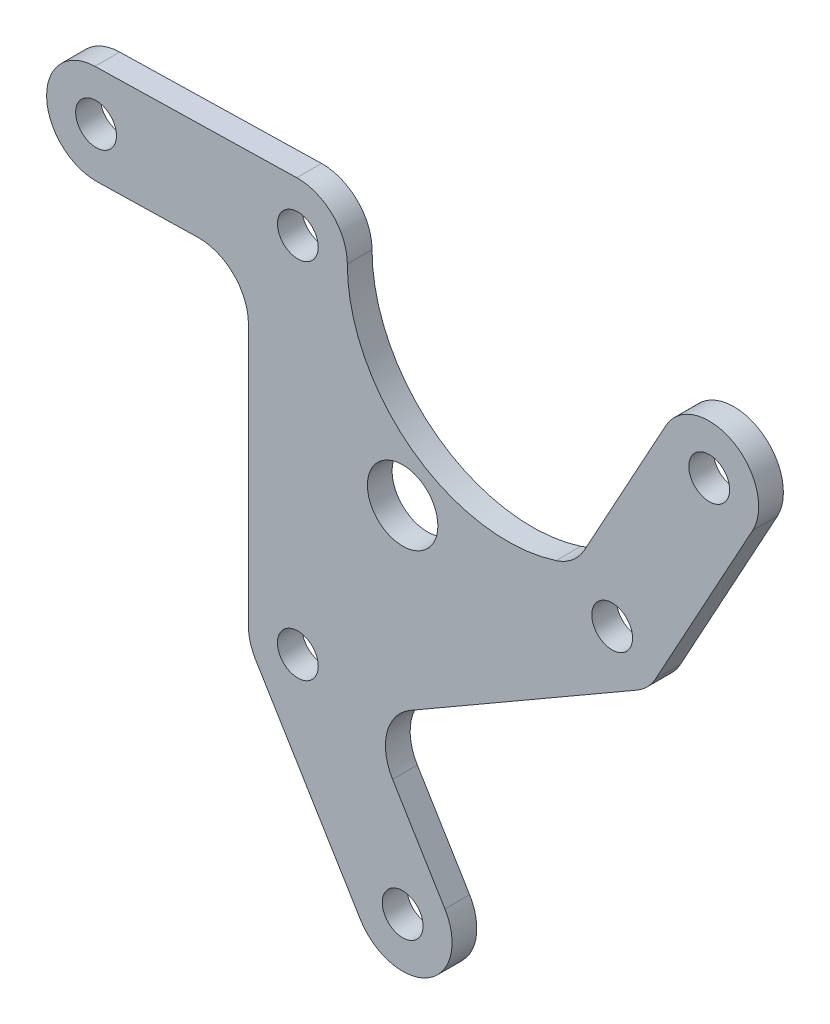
ISO-10303-21;
HEADER;
FILE_DESCRIPTION(('STEP AP214'),'2;1');
FILE_NAME('part.step','',(''),(''),'','','');
FILE_SCHEMA(('AUTOMOTIVE_DESIGN { 1 0 10303 214 1 1 1 1 }'));
ENDSEC;
DATA;
#1=APPLICATION_CONTEXT('core data for automotive mechanical design processes');
#2=APPLICATION_PROTOCOL_DEFINITION('international standard','automotive_design',2000,#1);
#3=PRODUCT_CONTEXT('',#1,'mechanical');
#4=PRODUCT('Part','Part','',(#3));
#5=PRODUCT_RELATED_PRODUCT_CATEGORY('part','',(#4));
#6=PRODUCT_DEFINITION_FORMATION('','',#4);
#7=PRODUCT_DEFINITION_CONTEXT('part definition',#1,'design');
#8=PRODUCT_DEFINITION('design','',#6,#7);
#9=PRODUCT_DEFINITION_SHAPE('','',#8);
#10=(LENGTH_UNIT() NAMED_UNIT(*) SI_UNIT(.MILLI.,.METRE.));
#11=(NAMED_UNIT(*) PLANE_ANGLE_UNIT() SI_UNIT($,.RADIAN.));
#12=(NAMED_UNIT(*) SI_UNIT($,.STERADIAN.) SOLID_ANGLE_UNIT());
#13=UNCERTAINTY_MEASURE_WITH_UNIT(LENGTH_MEASURE(1.E-05),#10,'distance_accuracy_value','');
#14=(GEOMETRIC_REPRESENTATION_CONTEXT(3) GLOBAL_UNCERTAINTY_ASSIGNED_CONTEXT((#13)) GLOBAL_UNIT_ASSIGNED_CONTEXT((#10,
#11,#12)) REPRESENTATION_CONTEXT('',''));
#15=CARTESIAN_POINT('',(0.,0.,0.));
#16=DIRECTION('',(0.,0.,1.));
#17=DIRECTION('',(1.,0.,0.));
#18=AXIS2_PLACEMENT_3D('',#15,#16,#17);
#19=CARTESIAN_POINT('',(-8.47500000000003,14.6791305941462,2.));
#20=DIRECTION('',(0.,0.,-1.));
#21=DIRECTION('',(-1.,0.,0.));
#22=AXIS2_PLACEMENT_3D('',#19,#20,#21);
#23=CYLINDRICAL_SURFACE('',#22,3.99999999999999);
#24=DIRECTION('',(0.,0.,-1.));
#25=VECTOR('',#24,1.);
#26=CARTESIAN_POINT('',(-8.56339345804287,18.6781537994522,2.));
#27=LINE('',#26,#25);
#28=CARTESIAN_POINT('',(-8.56339345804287,18.6781537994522,2.));
#29=VERTEX_POINT('',#28);
#30=CARTESIAN_POINT('',(-8.56339345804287,18.6781537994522,0.));
#31=VERTEX_POINT('',#30);
#32=EDGE_CURVE('E295',#29,#31,#27,.T.);
#33=ORIENTED_EDGE('',*,*,#32,.F.);
#34=CARTESIAN_POINT('',(-8.47500000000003,14.6791305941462,2.));
#35=DIRECTION('',(0.,0.,1.));
#36=DIRECTION('',(1.,0.,0.));
#37=AXIS2_PLACEMENT_3D('',#34,#35,#36);
#38=CIRCLE('',#37,3.99999999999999);
#39=CARTESIAN_POINT('',(-4.475,14.6791305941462,2.));
#40=VERTEX_POINT('',#39);
#41=EDGE_CURVE('E336',#40,#29,#38,.T.);
#42=ORIENTED_EDGE('',*,*,#41,.F.);
#43=DIRECTION('',(0.,0.,-1.));
#44=VECTOR('',#43,1.);
#45=CARTESIAN_POINT('',(-4.475,14.6791305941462,2.));
#46=LINE('',#45,#44);
#47=CARTESIAN_POINT('',(-4.475,14.6791305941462,0.));
#48=VERTEX_POINT('',#47);
#49=EDGE_CURVE('E358',#40,#48,#46,.T.);
#50=ORIENTED_EDGE('',*,*,#49,.T.);
#51=CARTESIAN_POINT('',(-8.47500000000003,14.6791305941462,0.));
#52=DIRECTION('',(0.,0.,1.));
#53=DIRECTION('',(1.,0.,0.));
#54=AXIS2_PLACEMENT_3D('',#51,#52,#53);
#55=CIRCLE('',#54,3.99999999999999);
#56=EDGE_CURVE('E332',#48,#31,#55,.T.);
#57=ORIENTED_EDGE('',*,*,#56,.T.);
#58=EDGE_LOOP('',(#33,#42,#50,#57));
#59=FACE_BOUND('',#58,.T.);
#60=ADVANCED_FACE('F45',(#59),#23,.T.);
#61=CARTESIAN_POINT('',(-12.475,14.6791305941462,2.));
#62=DIRECTION('',(1.,0.,0.));
#63=DIRECTION('',(0.,0.,-1.));
#64=AXIS2_PLACEMENT_3D('',#61,#62,#63);
#65=PLANE('',#64);
#66=DIRECTION('',(0.,-1.,0.));
#67=VECTOR('',#66,1.);
#68=CARTESIAN_POINT('',(-12.475,14.6791305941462,2.));
#69=LINE('',#68,#67);
#70=CARTESIAN_POINT('',(-12.475,6.50034642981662,2.));
#71=VERTEX_POINT('',#70);
#72=CARTESIAN_POINT('',(-12.475,-14.6791305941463,2.));
#73=VERTEX_POINT('',#72);
#74=EDGE_CURVE('E340',#71,#73,#69,.T.);
#75=ORIENTED_EDGE('',*,*,#74,.F.);
#76=DIRECTION('',(0.,0.,1.));
#77=VECTOR('',#76,1.);
#78=CARTESIAN_POINT('',(-12.475,6.50034642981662,0.));
#79=LINE('',#78,#77);
#80=CARTESIAN_POINT('',(-12.475,6.50034642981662,0.));
#81=VERTEX_POINT('',#80);
#82=EDGE_CURVE('E67',#71,#81,#79,.F.);
#83=ORIENTED_EDGE('',*,*,#82,.T.);
#84=DIRECTION('',(0.,-1.,0.));
#85=VECTOR('',#84,1.);
#86=CARTESIAN_POINT('',(-12.475,14.6791305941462,0.));
#87=LINE('',#86,#85);
#88=CARTESIAN_POINT('',(-12.475,-14.6791305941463,0.));
#89=VERTEX_POINT('',#88);
#90=EDGE_CURVE('E361',#81,#89,#87,.T.);
#91=ORIENTED_EDGE('',*,*,#90,.T.);
#92=DIRECTION('',(0.,0.,-1.));
#93=VECTOR('',#92,1.);
#94=CARTESIAN_POINT('',(-12.475,-14.6791305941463,2.));
#95=LINE('',#94,#93);
#96=EDGE_CURVE('E382',#73,#89,#95,.T.);
#97=ORIENTED_EDGE('',*,*,#96,.F.);
#98=EDGE_LOOP('',(#75,#83,#91,#97));
#99=FACE_BOUND('',#98,.T.);
#100=ADVANCED_FACE('F473',(#99),#65,.F.);
#101=CARTESIAN_POINT('',(-8.47499999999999,-14.6791305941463,2.));
#102=DIRECTION('',(0.,0.,-1.));
#103=DIRECTION('',(-1.,0.,0.));
#104=AXIS2_PLACEMENT_3D('',#101,#102,#103);
#105=CYLINDRICAL_SURFACE('',#104,4.);
#106=DIRECTION('',(0.,0.,-1.));
#107=VECTOR('',#106,1.);
#108=CARTESIAN_POINT('',(-11.894058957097,-16.7551931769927,2.));
#109=LINE('',#108,#107);
#110=CARTESIAN_POINT('',(-11.894058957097,-16.7551931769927,2.));
#111=VERTEX_POINT('',#110);
#112=CARTESIAN_POINT('',(-11.894058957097,-16.7551931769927,0.));
#113=VERTEX_POINT('',#112);
#114=EDGE_CURVE('E224',#111,#113,#109,.T.);
#115=ORIENTED_EDGE('',*,*,#114,.F.);
#116=CARTESIAN_POINT('',(-8.47499999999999,-14.6791305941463,2.));
#117=DIRECTION('',(0.,0.,1.));
#118=DIRECTION('',(1.,0.,0.));
#119=AXIS2_PLACEMENT_3D('',#116,#117,#118);
#120=CIRCLE('',#119,4.);
#121=EDGE_CURVE('E344',#73,#111,#120,.T.);
#122=ORIENTED_EDGE('',*,*,#121,.F.);
#123=ORIENTED_EDGE('',*,*,#96,.T.);
#124=CARTESIAN_POINT('',(-8.47499999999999,-14.6791305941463,0.));
#125=DIRECTION('',(0.,0.,1.));
#126=DIRECTION('',(1.,0.,0.));
#127=AXIS2_PLACEMENT_3D('',#124,#125,#126);
#128=CIRCLE('',#127,4.);
#129=EDGE_CURVE('E364',#89,#113,#128,.T.);
#130=ORIENTED_EDGE('',*,*,#129,.T.);
#131=EDGE_LOOP('',(#115,#122,#123,#130));
#132=FACE_BOUND('',#131,.T.);
#133=ADVANCED_FACE('F476',(#132),#105,.T.);
#134=CARTESIAN_POINT('',(-6.47499999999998,-18.143232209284,2.));
#135=DIRECTION('',(-0.500000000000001,0.866025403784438,0.));
#136=DIRECTION('',(-0.866025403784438,-0.500000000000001,0.));
#137=AXIS2_PLACEMENT_3D('',#134,#135,#136);
#138=PLANE('',#137);
#139=DIRECTION('',(0.866025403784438,0.500000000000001,0.));
#140=VECTOR('',#139,1.);
#141=CARTESIAN_POINT('',(-6.47499999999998,-18.143232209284,2.));
#142=LINE('',#141,#140);
#143=CARTESIAN_POINT('',(0.608034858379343,-14.0538401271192,2.));
#144=VERTEX_POINT('',#143);
#145=CARTESIAN_POINT('',(18.95,-3.46410161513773,2.));
#146=VERTEX_POINT('',#145);
#147=EDGE_CURVE('E348',#144,#146,#142,.T.);
#148=ORIENTED_EDGE('',*,*,#147,.F.);
#149=DIRECTION('',(0.,0.,1.));
#150=VECTOR('',#149,1.);
#151=CARTESIAN_POINT('',(0.608034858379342,-14.0538401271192,0.));
#152=LINE('',#151,#150);
#153=CARTESIAN_POINT('',(0.608034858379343,-14.0538401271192,0.));
#154=VERTEX_POINT('',#153);
#155=EDGE_CURVE('E397',#144,#154,#152,.F.);
#156=ORIENTED_EDGE('',*,*,#155,.T.);
#157=DIRECTION('',(0.866025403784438,0.500000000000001,0.));
#158=VECTOR('',#157,1.);
#159=CARTESIAN_POINT('',(-6.47499999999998,-18.143232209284,0.));
#160=LINE('',#159,#158);
#161=CARTESIAN_POINT('',(18.95,-3.46410161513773,0.));
#162=VERTEX_POINT('',#161);
#163=EDGE_CURVE('E367',#154,#162,#160,.T.);
#164=ORIENTED_EDGE('',*,*,#163,.T.);
#165=DIRECTION('',(0.,0.,-1.));
#166=VECTOR('',#165,1.);
#167=CARTESIAN_POINT('',(18.95,-3.46410161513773,2.));
#168=LINE('',#167,#166);
#169=EDGE_CURVE('E378',#146,#162,#168,.T.);
#170=ORIENTED_EDGE('',*,*,#169,.F.);
#171=EDGE_LOOP('',(#148,#156,#164,#170));
#172=FACE_BOUND('',#171,.T.);
#173=ADVANCED_FACE('F432',(#172),#138,.F.);
#174=CARTESIAN_POINT('',(16.95,0.,2.));
#175=DIRECTION('',(0.,0.,-1.));
#176=DIRECTION('',(-1.,0.,0.));
#177=AXIS2_PLACEMENT_3D('',#174,#175,#176);
#178=CYLINDRICAL_SURFACE('',#177,4.);
#179=DIRECTION('',(0.,0.,-1.));
#180=VECTOR('',#179,1.);
#181=CARTESIAN_POINT('',(20.4574524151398,-1.92296062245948,2.));
#182=LINE('',#181,#180);
#183=CARTESIAN_POINT('',(20.4574524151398,-1.92296062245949,2.));
#184=VERTEX_POINT('',#183);
#185=CARTESIAN_POINT('',(20.4574524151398,-1.92296062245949,0.));
#186=VERTEX_POINT('',#185);
#187=EDGE_CURVE('E176',#184,#186,#182,.T.);
#188=ORIENTED_EDGE('',*,*,#187,.F.);
#189=CARTESIAN_POINT('',(16.95,0.,2.));
#190=DIRECTION('',(0.,0.,1.));
#191=DIRECTION('',(1.,0.,0.));
#192=AXIS2_PLACEMENT_3D('',#189,#190,#191);
#193=CIRCLE('',#192,4.);
#194=EDGE_CURVE('E351',#146,#184,#193,.T.);
#195=ORIENTED_EDGE('',*,*,#194,.F.);
#196=ORIENTED_EDGE('',*,*,#169,.T.);
#197=CARTESIAN_POINT('',(16.95,0.,0.));
#198=DIRECTION('',(0.,0.,1.));
#199=DIRECTION('',(1.,0.,0.));
#200=AXIS2_PLACEMENT_3D('',#197,#198,#199);
#201=CIRCLE('',#200,4.);
#202=EDGE_CURVE('E370',#162,#186,#201,.T.);
#203=ORIENTED_EDGE('',*,*,#202,.T.);
#204=EDGE_LOOP('',(#188,#195,#196,#203));
#205=FACE_BOUND('',#204,.T.);
#206=ADVANCED_FACE('F435',(#205),#178,.T.);
#207=CARTESIAN_POINT('',(8.475,14.6791305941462,2.));
#208=DIRECTION('',(0.,0.,-1.));
#209=DIRECTION('',(-1.,0.,0.));
#210=AXIS2_PLACEMENT_3D('',#207,#208,#209);
#211=CYLINDRICAL_SURFACE('',#210,12.95);
#212=CARTESIAN_POINT('',(8.475,14.6791305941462,2.));
#213=DIRECTION('',(0.,0.,-1.));
#214=DIRECTION('',(1.,0.,0.));
#215=AXIS2_PLACEMENT_3D('',#212,#213,#214);
#216=CIRCLE('',#215,12.95);
#217=CARTESIAN_POINT('',(12.418808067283,2.34426626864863,2.));
#218=VERTEX_POINT('',#217);
#219=EDGE_CURVE('E355',#218,#40,#216,.T.);
#220=ORIENTED_EDGE('',*,*,#219,.F.);
#221=DIRECTION('',(0.,0.,-1.));
#222=VECTOR('',#221,1.);
#223=CARTESIAN_POINT('',(12.418808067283,2.34426626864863,2.));
#224=LINE('',#223,#222);
#225=CARTESIAN_POINT('',(12.418808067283,2.34426626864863,0.));
#226=VERTEX_POINT('',#225);
#227=EDGE_CURVE('E390',#218,#226,#224,.T.);
#228=ORIENTED_EDGE('',*,*,#227,.T.);
#229=CARTESIAN_POINT('',(8.475,14.6791305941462,0.));
#230=DIRECTION('',(0.,0.,-1.));
#231=DIRECTION('',(1.,0.,0.));
#232=AXIS2_PLACEMENT_3D('',#229,#230,#231);
#233=CIRCLE('',#232,12.95);
#234=EDGE_CURVE('E341',#226,#48,#233,.T.);
#235=ORIENTED_EDGE('',*,*,#234,.T.);
#236=ORIENTED_EDGE('',*,*,#49,.F.);
#237=EDGE_LOOP('',(#220,#228,#235,#236));
#238=FACE_BOUND('',#237,.T.);
#239=ADVANCED_FACE('F450',(#238),#211,.F.);
#240=CARTESIAN_POINT('',(-8.47500000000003,14.6791305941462,2.));
#241=DIRECTION('',(0.,0.,1.));
#242=DIRECTION('',(1.,0.,0.));
#243=AXIS2_PLACEMENT_3D('',#240,#241,#242);
#244=PLANE('',#243);
#245=DIRECTION('',(-0.519015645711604,0.854764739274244,0.));
#246=VECTOR('',#245,1.);
#247=CARTESIAN_POINT('',(3.419058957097,-26.560510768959,2.));
#248=LINE('',#247,#246);
#249=CARTESIAN_POINT('',(3.419058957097,-26.560510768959,2.));
#250=VERTEX_POINT('',#249);
#251=CARTESIAN_POINT('',(-0.811024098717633,-19.5940043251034,2.));
#252=VERTEX_POINT('',#251);
#253=EDGE_CURVE('E248',#250,#252,#248,.T.);
#254=ORIENTED_EDGE('',*,*,#253,.T.);
#255=CARTESIAN_POINT('',(2.60803485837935,-17.5179417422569,2.));
#256=DIRECTION('',(0.,0.,1.));
#257=DIRECTION('',(1.,0.,0.));
#258=AXIS2_PLACEMENT_3D('',#255,#256,#257);
#259=CIRCLE('',#258,4.);
#260=EDGE_CURVE('E412',#252,#144,#259,.F.);
#261=ORIENTED_EDGE('',*,*,#260,.T.);
#262=ORIENTED_EDGE('',*,*,#147,.T.);
#263=ORIENTED_EDGE('',*,*,#194,.T.);
#264=DIRECTION('',(0.480740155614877,0.876863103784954,0.));
#265=VECTOR('',#264,1.);
#266=CARTESIAN_POINT('',(28.3074524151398,12.3953260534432,2.));
#267=LINE('',#266,#265);
#268=CARTESIAN_POINT('',(28.3074524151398,12.3953260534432,2.));
#269=VERTEX_POINT('',#268);
#270=EDGE_CURVE('E191',#184,#269,#267,.T.);
#271=ORIENTED_EDGE('',*,*,#270,.T.);
#272=CARTESIAN_POINT('',(24.8,14.3182866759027,2.));
#273=DIRECTION('',(0.,0.,1.));
#274=DIRECTION('',(1.,0.,0.));
#275=AXIS2_PLACEMENT_3D('',#272,#273,#274);
#276=CIRCLE('',#275,3.99999999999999);
#277=CARTESIAN_POINT('',(21.2925475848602,16.2412472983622,2.));
#278=VERTEX_POINT('',#277);
#279=EDGE_CURVE('E182',#269,#278,#276,.T.);
#280=ORIENTED_EDGE('',*,*,#279,.T.);
#281=DIRECTION('',(-0.480740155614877,-0.876863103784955,0.));
#282=VECTOR('',#281,1.);
#283=CARTESIAN_POINT('',(21.2925475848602,16.2412472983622,2.));
#284=LINE('',#283,#282);
#285=CARTESIAN_POINT('',(14.7080958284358,4.23130234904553,2.));
#286=VERTEX_POINT('',#285);
#287=EDGE_CURVE('E210',#278,#286,#284,.T.);
#288=ORIENTED_EDGE('',*,*,#287,.T.);
#289=CARTESIAN_POINT('',(11.200643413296,6.15426297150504,2.));
#290=DIRECTION('',(0.,0.,1.));
#291=DIRECTION('',(1.,0.,0.));
#292=AXIS2_PLACEMENT_3D('',#289,#290,#291);
#293=CIRCLE('',#292,4.);
#294=EDGE_CURVE('E406',#286,#218,#293,.F.);
#295=ORIENTED_EDGE('',*,*,#294,.T.);
#296=ORIENTED_EDGE('',*,*,#219,.T.);
#297=ORIENTED_EDGE('',*,*,#41,.T.);
#298=DIRECTION('',(-0.99975580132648,-0.02209836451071,0.));
#299=VECTOR('',#298,1.);
#300=CARTESIAN_POINT('',(-24.8883934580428,18.3173098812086,2.));
#301=LINE('',#300,#299);
#302=CARTESIAN_POINT('',(-24.8883934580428,18.3173098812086,2.));
#303=VERTEX_POINT('',#302);
#304=EDGE_CURVE('E279',#29,#303,#301,.T.);
#305=ORIENTED_EDGE('',*,*,#304,.T.);
#306=CARTESIAN_POINT('',(-24.8,14.3182866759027,2.));
#307=DIRECTION('',(0.,0.,1.));
#308=DIRECTION('',(1.,0.,0.));
#309=AXIS2_PLACEMENT_3D('',#306,#307,#308);
#310=CIRCLE('',#309,4.);
#311=CARTESIAN_POINT('',(-24.7116065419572,10.3192634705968,2.));
#312=VERTEX_POINT('',#311);
#313=EDGE_CURVE('E271',#303,#312,#310,.T.);
#314=ORIENTED_EDGE('',*,*,#313,.T.);
#315=DIRECTION('',(0.99975580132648,0.0220983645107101,0.));
#316=VECTOR('',#315,1.);
#317=CARTESIAN_POINT('',(-24.7116065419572,10.3192634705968,2.));
#318=LINE('',#317,#316);
#319=CARTESIAN_POINT('',(-16.5633934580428,10.4993696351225,2.));
#320=VERTEX_POINT('',#319);
#321=EDGE_CURVE('E275',#312,#320,#318,.T.);
#322=ORIENTED_EDGE('',*,*,#321,.T.);
#323=CARTESIAN_POINT('',(-16.475,6.50034642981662,2.));
#324=DIRECTION('',(0.,0.,1.));
#325=DIRECTION('',(1.,0.,0.));
#326=AXIS2_PLACEMENT_3D('',#323,#324,#325);
#327=CIRCLE('',#326,4.);
#328=EDGE_CURVE('E54',#320,#71,#327,.F.);
#329=ORIENTED_EDGE('',*,*,#328,.T.);
#330=ORIENTED_EDGE('',*,*,#74,.T.);
#331=ORIENTED_EDGE('',*,*,#121,.T.);
#332=DIRECTION('',(0.519015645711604,-0.854764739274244,0.));
#333=VECTOR('',#332,1.);
#334=CARTESIAN_POINT('',(-3.41905895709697,-30.7126359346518,2.));
#335=LINE('',#334,#333);
#336=CARTESIAN_POINT('',(-3.41905895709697,-30.7126359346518,2.));
#337=VERTEX_POINT('',#336);
#338=EDGE_CURVE('E232',#111,#337,#335,.T.);
#339=ORIENTED_EDGE('',*,*,#338,.T.);
#340=CARTESIAN_POINT('',(0.,-28.6365733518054,2.));
#341=DIRECTION('',(0.,0.,1.));
#342=DIRECTION('',(1.,0.,0.));
#343=AXIS2_PLACEMENT_3D('',#340,#341,#342);
#344=CIRCLE('',#343,4.);
#345=EDGE_CURVE('E237',#337,#250,#344,.T.);
#346=ORIENTED_EDGE('',*,*,#345,.T.);
#347=EDGE_LOOP('',(#254,#261,#262,#263,#271,#280,#288,#295,#296,#297,#305,#314,#322,#329,#330,
#331,#339,#346));
#348=FACE_BOUND('',#347,.T.);
#349=CARTESIAN_POINT('',(-8.47500000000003,14.6791305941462,2.));
#350=DIRECTION('',(0.,0.,1.));
#351=DIRECTION('',(1.,0.,0.));
#352=AXIS2_PLACEMENT_3D('',#349,#350,#351);
#353=CIRCLE('',#352,1.65);
#354=CARTESIAN_POINT('',(-6.82500000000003,14.6791305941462,2.));
#355=VERTEX_POINT('',#354);
#356=EDGE_CURVE('E328',#355,#355,#353,.T.);
#357=ORIENTED_EDGE('',*,*,#356,.F.);
#358=EDGE_LOOP('',(#357));
#359=FACE_BOUND('',#358,.T.);
#360=CARTESIAN_POINT('',(-24.8,14.3182866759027,2.));
#361=DIRECTION('',(0.,0.,1.));
#362=DIRECTION('',(1.,0.,0.));
#363=AXIS2_PLACEMENT_3D('',#360,#361,#362);
#364=CIRCLE('',#363,1.65);
#365=CARTESIAN_POINT('',(-23.15,14.3182866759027,2.));
#366=VERTEX_POINT('',#365);
#367=EDGE_CURVE('E263',#366,#366,#364,.T.);
#368=ORIENTED_EDGE('',*,*,#367,.F.);
#369=EDGE_LOOP('',(#368));
#370=FACE_BOUND('',#369,.T.);
#371=CARTESIAN_POINT('',(0.,0.,2.));
#372=DIRECTION('',(0.,0.,1.));
#373=DIRECTION('',(1.,0.,0.));
#374=AXIS2_PLACEMENT_3D('',#371,#372,#373);
#375=CIRCLE('',#374,2.85);
#376=CARTESIAN_POINT('',(2.85,0.,2.));
#377=VERTEX_POINT('',#376);
#378=EDGE_CURVE('E304',#377,#377,#375,.T.);
#379=ORIENTED_EDGE('',*,*,#378,.F.);
#380=EDGE_LOOP('',(#379));
#381=FACE_BOUND('',#380,.T.);
#382=CARTESIAN_POINT('',(16.95,0.,2.));
#383=DIRECTION('',(0.,0.,1.));
#384=DIRECTION('',(1.,0.,0.));
#385=AXIS2_PLACEMENT_3D('',#382,#383,#384);
#386=CIRCLE('',#385,1.65);
#387=CARTESIAN_POINT('',(18.6,0.,2.));
#388=VERTEX_POINT('',#387);
#389=EDGE_CURVE('E320',#388,#388,#386,.T.);
#390=ORIENTED_EDGE('',*,*,#389,.F.);
#391=EDGE_LOOP('',(#390));
#392=FACE_BOUND('',#391,.T.);
#393=CARTESIAN_POINT('',(24.8,14.3182866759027,2.));
#394=DIRECTION('',(0.,0.,1.));
#395=DIRECTION('',(1.,0.,0.));
#396=AXIS2_PLACEMENT_3D('',#393,#394,#395);
#397=CIRCLE('',#396,1.65);
#398=CARTESIAN_POINT('',(26.45,14.3182866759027,2.));
#399=VERTEX_POINT('',#398);
#400=EDGE_CURVE('E199',#399,#399,#397,.T.);
#401=ORIENTED_EDGE('',*,*,#400,.F.);
#402=EDGE_LOOP('',(#401));
#403=FACE_BOUND('',#402,.T.);
#404=CARTESIAN_POINT('',(-8.47499999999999,-14.6791305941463,2.));
#405=DIRECTION('',(0.,0.,1.));
#406=DIRECTION('',(1.,0.,0.));
#407=AXIS2_PLACEMENT_3D('',#404,#405,#406);
#408=CIRCLE('',#407,1.65);
#409=CARTESIAN_POINT('',(-6.82499999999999,-14.6791305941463,2.));
#410=VERTEX_POINT('',#409);
#411=EDGE_CURVE('E312',#410,#410,#408,.T.);
#412=ORIENTED_EDGE('',*,*,#411,.F.);
#413=EDGE_LOOP('',(#412));
#414=FACE_BOUND('',#413,.T.);
#415=CARTESIAN_POINT('',(0.,-28.6365733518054,2.));
#416=DIRECTION('',(0.,0.,1.));
#417=DIRECTION('',(1.,0.,0.));
#418=AXIS2_PLACEMENT_3D('',#415,#416,#417);
#419=CIRCLE('',#418,1.65);
#420=CARTESIAN_POINT('',(1.65,-28.6365733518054,2.));
#421=VERTEX_POINT('',#420);
#422=EDGE_CURVE('E245',#421,#421,#419,.T.);
#423=ORIENTED_EDGE('',*,*,#422,.F.);
#424=EDGE_LOOP('',(#423));
#425=FACE_BOUND('',#424,.T.);
#426=ADVANCED_FACE('F428',(#348,#359,#370,#381,#392,#403,#414,#425),#244,.T.);
#427=CARTESIAN_POINT('',(-8.47500000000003,14.6791305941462,0.));
#428=DIRECTION('',(0.,0.,1.));
#429=DIRECTION('',(1.,0.,0.));
#430=AXIS2_PLACEMENT_3D('',#427,#428,#429);
#431=PLANE('',#430);
#432=ORIENTED_EDGE('',*,*,#163,.F.);
#433=CARTESIAN_POINT('',(2.60803485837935,-17.5179417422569,0.));
#434=DIRECTION('',(0.,0.,1.));
#435=DIRECTION('',(1.,0.,0.));
#436=AXIS2_PLACEMENT_3D('',#433,#434,#435);
#437=CIRCLE('',#436,4.);
#438=CARTESIAN_POINT('',(-0.811024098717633,-19.5940043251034,0.));
#439=VERTEX_POINT('',#438);
#440=EDGE_CURVE('E415',#154,#439,#437,.T.);
#441=ORIENTED_EDGE('',*,*,#440,.T.);
#442=DIRECTION('',(-0.519015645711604,0.854764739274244,0.));
#443=VECTOR('',#442,1.);
#444=CARTESIAN_POINT('',(3.419058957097,-26.560510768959,0.));
#445=LINE('',#444,#443);
#446=CARTESIAN_POINT('',(3.419058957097,-26.560510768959,0.));
#447=VERTEX_POINT('',#446);
#448=EDGE_CURVE('E236',#447,#439,#445,.T.);
#449=ORIENTED_EDGE('',*,*,#448,.F.);
#450=CARTESIAN_POINT('',(0.,-28.6365733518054,0.));
#451=DIRECTION('',(0.,0.,1.));
#452=DIRECTION('',(1.,0.,0.));
#453=AXIS2_PLACEMENT_3D('',#450,#451,#452);
#454=CIRCLE('',#453,4.);
#455=CARTESIAN_POINT('',(-3.41905895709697,-30.7126359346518,0.));
#456=VERTEX_POINT('',#455);
#457=EDGE_CURVE('E241',#456,#447,#454,.T.);
#458=ORIENTED_EDGE('',*,*,#457,.F.);
#459=DIRECTION('',(0.519015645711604,-0.854764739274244,0.));
#460=VECTOR('',#459,1.);
#461=CARTESIAN_POINT('',(-3.41905895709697,-30.7126359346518,0.));
#462=LINE('',#461,#460);
#463=EDGE_CURVE('E233',#113,#456,#462,.T.);
#464=ORIENTED_EDGE('',*,*,#463,.F.);
#465=ORIENTED_EDGE('',*,*,#129,.F.);
#466=ORIENTED_EDGE('',*,*,#90,.F.);
#467=CARTESIAN_POINT('',(-16.475,6.50034642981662,0.));
#468=DIRECTION('',(0.,0.,1.));
#469=DIRECTION('',(1.,0.,0.));
#470=AXIS2_PLACEMENT_3D('',#467,#468,#469);
#471=CIRCLE('',#470,4.);
#472=CARTESIAN_POINT('',(-16.5633934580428,10.4993696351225,0.));
#473=VERTEX_POINT('',#472);
#474=EDGE_CURVE('E11',#81,#473,#471,.T.);
#475=ORIENTED_EDGE('',*,*,#474,.T.);
#476=DIRECTION('',(0.99975580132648,0.0220983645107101,0.));
#477=VECTOR('',#476,1.);
#478=CARTESIAN_POINT('',(-24.7116065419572,10.3192634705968,0.));
#479=LINE('',#478,#477);
#480=CARTESIAN_POINT('',(-24.7116065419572,10.3192634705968,0.));
#481=VERTEX_POINT('',#480);
#482=EDGE_CURVE('E286',#481,#473,#479,.T.);
#483=ORIENTED_EDGE('',*,*,#482,.F.);
#484=CARTESIAN_POINT('',(-24.8,14.3182866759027,0.));
#485=DIRECTION('',(0.,0.,1.));
#486=DIRECTION('',(1.,0.,0.));
#487=AXIS2_PLACEMENT_3D('',#484,#485,#486);
#488=CIRCLE('',#487,4.);
#489=CARTESIAN_POINT('',(-24.8883934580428,18.3173098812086,0.));
#490=VERTEX_POINT('',#489);
#491=EDGE_CURVE('E267',#490,#481,#488,.T.);
#492=ORIENTED_EDGE('',*,*,#491,.F.);
#493=DIRECTION('',(-0.99975580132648,-0.02209836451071,0.));
#494=VECTOR('',#493,1.);
#495=CARTESIAN_POINT('',(-24.8883934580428,18.3173098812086,0.));
#496=LINE('',#495,#494);
#497=EDGE_CURVE('E276',#31,#490,#496,.T.);
#498=ORIENTED_EDGE('',*,*,#497,.F.);
#499=ORIENTED_EDGE('',*,*,#56,.F.);
#500=ORIENTED_EDGE('',*,*,#234,.F.);
#501=CARTESIAN_POINT('',(11.200643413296,6.15426297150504,0.));
#502=DIRECTION('',(0.,0.,1.));
#503=DIRECTION('',(1.,0.,0.));
#504=AXIS2_PLACEMENT_3D('',#501,#502,#503);
#505=CIRCLE('',#504,4.);
#506=CARTESIAN_POINT('',(14.7080958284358,4.23130234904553,0.));
#507=VERTEX_POINT('',#506);
#508=EDGE_CURVE('E409',#226,#507,#505,.T.);
#509=ORIENTED_EDGE('',*,*,#508,.T.);
#510=DIRECTION('',(-0.480740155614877,-0.876863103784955,0.));
#511=VECTOR('',#510,1.);
#512=CARTESIAN_POINT('',(21.2925475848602,16.2412472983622,0.));
#513=LINE('',#512,#511);
#514=CARTESIAN_POINT('',(21.2925475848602,16.2412472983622,0.));
#515=VERTEX_POINT('',#514);
#516=EDGE_CURVE('E181',#515,#507,#513,.T.);
#517=ORIENTED_EDGE('',*,*,#516,.F.);
#518=CARTESIAN_POINT('',(24.8,14.3182866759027,0.));
#519=DIRECTION('',(0.,0.,1.));
#520=DIRECTION('',(1.,0.,0.));
#521=AXIS2_PLACEMENT_3D('',#518,#519,#520);
#522=CIRCLE('',#521,3.99999999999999);
#523=CARTESIAN_POINT('',(28.3074524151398,12.3953260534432,0.));
#524=VERTEX_POINT('',#523);
#525=EDGE_CURVE('E188',#524,#515,#522,.T.);
#526=ORIENTED_EDGE('',*,*,#525,.F.);
#527=DIRECTION('',(0.480740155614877,0.876863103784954,0.));
#528=VECTOR('',#527,1.);
#529=CARTESIAN_POINT('',(28.3074524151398,12.3953260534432,0.));
#530=LINE('',#529,#528);
#531=EDGE_CURVE('E170',#186,#524,#530,.T.);
#532=ORIENTED_EDGE('',*,*,#531,.F.);
#533=ORIENTED_EDGE('',*,*,#202,.F.);
#534=EDGE_LOOP('',(#432,#441,#449,#458,#464,#465,#466,#475,#483,#492,#498,#499,#500,#509,#517,
#526,#532,#533));
#535=FACE_BOUND('',#534,.T.);
#536=CARTESIAN_POINT('',(-8.47500000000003,14.6791305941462,0.));
#537=DIRECTION('',(0.,0.,1.));
#538=DIRECTION('',(1.,0.,0.));
#539=AXIS2_PLACEMENT_3D('',#536,#537,#538);
#540=CIRCLE('',#539,1.65);
#541=CARTESIAN_POINT('',(-6.82500000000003,14.6791305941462,0.));
#542=VERTEX_POINT('',#541);
#543=EDGE_CURVE('E324',#542,#542,#540,.T.);
#544=ORIENTED_EDGE('',*,*,#543,.T.);
#545=EDGE_LOOP('',(#544));
#546=FACE_BOUND('',#545,.T.);
#547=CARTESIAN_POINT('',(-24.8,14.3182866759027,0.));
#548=DIRECTION('',(0.,0.,1.));
#549=DIRECTION('',(1.,0.,0.));
#550=AXIS2_PLACEMENT_3D('',#547,#548,#549);
#551=CIRCLE('',#550,1.65);
#552=CARTESIAN_POINT('',(-23.15,14.3182866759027,0.));
#553=VERTEX_POINT('',#552);
#554=EDGE_CURVE('E218',#553,#553,#551,.T.);
#555=ORIENTED_EDGE('',*,*,#554,.T.);
#556=EDGE_LOOP('',(#555));
#557=FACE_BOUND('',#556,.T.);
#558=CARTESIAN_POINT('',(0.,0.,0.));
#559=DIRECTION('',(0.,0.,1.));
#560=DIRECTION('',(1.,0.,0.));
#561=AXIS2_PLACEMENT_3D('',#558,#559,#560);
#562=CIRCLE('',#561,2.85);
#563=CARTESIAN_POINT('',(2.85,0.,0.));
#564=VERTEX_POINT('',#563);
#565=EDGE_CURVE('E303',#564,#564,#562,.T.);
#566=ORIENTED_EDGE('',*,*,#565,.T.);
#567=EDGE_LOOP('',(#566));
#568=FACE_BOUND('',#567,.T.);
#569=CARTESIAN_POINT('',(16.95,0.,0.));
#570=DIRECTION('',(0.,0.,1.));
#571=DIRECTION('',(1.,0.,0.));
#572=AXIS2_PLACEMENT_3D('',#569,#570,#571);
#573=CIRCLE('',#572,1.65);
#574=CARTESIAN_POINT('',(18.6,0.,0.));
#575=VERTEX_POINT('',#574);
#576=EDGE_CURVE('E316',#575,#575,#573,.T.);
#577=ORIENTED_EDGE('',*,*,#576,.T.);
#578=EDGE_LOOP('',(#577));
#579=FACE_BOUND('',#578,.T.);
#580=CARTESIAN_POINT('',(24.8,14.3182866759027,0.));
#581=DIRECTION('',(0.,0.,1.));
#582=DIRECTION('',(1.,0.,0.));
#583=AXIS2_PLACEMENT_3D('',#580,#581,#582);
#584=CIRCLE('',#583,1.65);
#585=CARTESIAN_POINT('',(26.45,14.3182866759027,0.));
#586=VERTEX_POINT('',#585);
#587=EDGE_CURVE('E204',#586,#586,#584,.T.);
#588=ORIENTED_EDGE('',*,*,#587,.T.);
#589=EDGE_LOOP('',(#588));
#590=FACE_BOUND('',#589,.T.);
#591=CARTESIAN_POINT('',(-8.47499999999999,-14.6791305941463,0.));
#592=DIRECTION('',(0.,0.,1.));
#593=DIRECTION('',(1.,0.,0.));
#594=AXIS2_PLACEMENT_3D('',#591,#592,#593);
#595=CIRCLE('',#594,1.65);
#596=CARTESIAN_POINT('',(-6.82499999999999,-14.6791305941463,0.));
#597=VERTEX_POINT('',#596);
#598=EDGE_CURVE('E308',#597,#597,#595,.T.);
#599=ORIENTED_EDGE('',*,*,#598,.T.);
#600=EDGE_LOOP('',(#599));
#601=FACE_BOUND('',#600,.T.);
#602=CARTESIAN_POINT('',(0.,-28.6365733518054,0.));
#603=DIRECTION('',(0.,0.,1.));
#604=DIRECTION('',(1.,0.,0.));
#605=AXIS2_PLACEMENT_3D('',#602,#603,#604);
#606=CIRCLE('',#605,1.65);
#607=CARTESIAN_POINT('',(1.65,-28.6365733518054,0.));
#608=VERTEX_POINT('',#607);
#609=EDGE_CURVE('E255',#608,#608,#606,.T.);
#610=ORIENTED_EDGE('',*,*,#609,.T.);
#611=EDGE_LOOP('',(#610));
#612=FACE_BOUND('',#611,.T.);
#613=ADVANCED_FACE('F194',(#535,#546,#557,#568,#579,#590,#601,#612),#431,.F.);
#614=CARTESIAN_POINT('',(-8.47500000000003,14.6791305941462,2.));
#615=DIRECTION('',(0.,0.,-1.));
#616=DIRECTION('',(-1.,0.,0.));
#617=AXIS2_PLACEMENT_3D('',#614,#615,#616);
#618=CYLINDRICAL_SURFACE('',#617,1.65);
#619=ORIENTED_EDGE('',*,*,#356,.T.);
#620=EDGE_LOOP('',(#619));
#621=FACE_BOUND('',#620,.T.);
#622=ORIENTED_EDGE('',*,*,#543,.F.);
#623=EDGE_LOOP('',(#622));
#624=FACE_BOUND('',#623,.T.);
#625=ADVANCED_FACE('F624',(#621,#624),#618,.F.);
#626=CARTESIAN_POINT('',(16.95,0.,2.));
#627=DIRECTION('',(0.,0.,-1.));
#628=DIRECTION('',(-1.,0.,0.));
#629=AXIS2_PLACEMENT_3D('',#626,#627,#628);
#630=CYLINDRICAL_SURFACE('',#629,1.65);
#631=ORIENTED_EDGE('',*,*,#389,.T.);
#632=EDGE_LOOP('',(#631));
#633=FACE_BOUND('',#632,.T.);
#634=ORIENTED_EDGE('',*,*,#576,.F.);
#635=EDGE_LOOP('',(#634));
#636=FACE_BOUND('',#635,.T.);
#637=ADVANCED_FACE('F687',(#633,#636),#630,.F.);
#638=CARTESIAN_POINT('',(-8.47499999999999,-14.6791305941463,2.));
#639=DIRECTION('',(0.,0.,-1.));
#640=DIRECTION('',(-1.,0.,0.));
#641=AXIS2_PLACEMENT_3D('',#638,#639,#640);
#642=CYLINDRICAL_SURFACE('',#641,1.65);
#643=ORIENTED_EDGE('',*,*,#411,.T.);
#644=EDGE_LOOP('',(#643));
#645=FACE_BOUND('',#644,.T.);
#646=ORIENTED_EDGE('',*,*,#598,.F.);
#647=EDGE_LOOP('',(#646));
#648=FACE_BOUND('',#647,.T.);
#649=ADVANCED_FACE('F697',(#645,#648),#642,.F.);
#650=CARTESIAN_POINT('',(0.,0.,2.));
#651=DIRECTION('',(0.,0.,-1.));
#652=DIRECTION('',(-1.,0.,0.));
#653=AXIS2_PLACEMENT_3D('',#650,#651,#652);
#654=CYLINDRICAL_SURFACE('',#653,2.85);
#655=ORIENTED_EDGE('',*,*,#378,.T.);
#656=EDGE_LOOP('',(#655));
#657=FACE_BOUND('',#656,.T.);
#658=ORIENTED_EDGE('',*,*,#565,.F.);
#659=EDGE_LOOP('',(#658));
#660=FACE_BOUND('',#659,.T.);
#661=ADVANCED_FACE('F616',(#657,#660),#654,.F.);
#662=CARTESIAN_POINT('',(21.2925475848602,16.2412472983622,2.));
#663=DIRECTION('',(0.876863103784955,-0.480740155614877,0.));
#664=DIRECTION('',(0.480740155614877,0.876863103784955,0.));
#665=AXIS2_PLACEMENT_3D('',#662,#663,#664);
#666=PLANE('',#665);
#667=ORIENTED_EDGE('',*,*,#516,.T.);
#668=DIRECTION('',(0.,0.,1.));
#669=VECTOR('',#668,1.);
#670=CARTESIAN_POINT('',(14.7080958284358,4.23130234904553,2.));
#671=LINE('',#670,#669);
#672=EDGE_CURVE('E386',#507,#286,#671,.T.);
#673=ORIENTED_EDGE('',*,*,#672,.T.);
#674=ORIENTED_EDGE('',*,*,#287,.F.);
#675=DIRECTION('',(0.,0.,-1.));
#676=VECTOR('',#675,1.);
#677=CARTESIAN_POINT('',(21.2925475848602,16.2412472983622,2.));
#678=LINE('',#677,#676);
#679=EDGE_CURVE('E259',#278,#515,#678,.T.);
#680=ORIENTED_EDGE('',*,*,#679,.T.);
#681=EDGE_LOOP('',(#667,#673,#674,#680));
#682=FACE_BOUND('',#681,.T.);
#683=ADVANCED_FACE('F441',(#682),#666,.F.);
#684=CARTESIAN_POINT('',(24.8,14.3182866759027,2.));
#685=DIRECTION('',(0.,0.,-1.));
#686=DIRECTION('',(-1.,0.,0.));
#687=AXIS2_PLACEMENT_3D('',#684,#685,#686);
#688=CYLINDRICAL_SURFACE('',#687,3.99999999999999);
#689=ORIENTED_EDGE('',*,*,#525,.T.);
#690=ORIENTED_EDGE('',*,*,#679,.F.);
#691=ORIENTED_EDGE('',*,*,#279,.F.);
#692=DIRECTION('',(0.,0.,-1.));
#693=VECTOR('',#692,1.);
#694=CARTESIAN_POINT('',(28.3074524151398,12.3953260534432,2.));
#695=LINE('',#694,#693);
#696=EDGE_CURVE('E174',#269,#524,#695,.T.);
#697=ORIENTED_EDGE('',*,*,#696,.T.);
#698=EDGE_LOOP('',(#689,#690,#691,#697));
#699=FACE_BOUND('',#698,.T.);
#700=ADVANCED_FACE('F186',(#699),#688,.T.);
#701=CARTESIAN_POINT('',(28.3074524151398,12.3953260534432,2.));
#702=DIRECTION('',(-0.876863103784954,0.480740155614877,0.));
#703=DIRECTION('',(-0.480740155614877,-0.876863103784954,0.));
#704=AXIS2_PLACEMENT_3D('',#701,#702,#703);
#705=PLANE('',#704);
#706=ORIENTED_EDGE('',*,*,#531,.T.);
#707=ORIENTED_EDGE('',*,*,#696,.F.);
#708=ORIENTED_EDGE('',*,*,#270,.F.);
#709=ORIENTED_EDGE('',*,*,#187,.T.);
#710=EDGE_LOOP('',(#706,#707,#708,#709));
#711=FACE_BOUND('',#710,.T.);
#712=ADVANCED_FACE('F172',(#711),#705,.F.);
#713=CARTESIAN_POINT('',(24.8,14.3182866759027,2.));
#714=DIRECTION('',(0.,0.,-1.));
#715=DIRECTION('',(-1.,0.,0.));
#716=AXIS2_PLACEMENT_3D('',#713,#714,#715);
#717=CYLINDRICAL_SURFACE('',#716,1.65);
#718=ORIENTED_EDGE('',*,*,#400,.T.);
#719=EDGE_LOOP('',(#718));
#720=FACE_BOUND('',#719,.T.);
#721=ORIENTED_EDGE('',*,*,#587,.F.);
#722=EDGE_LOOP('',(#721));
#723=FACE_BOUND('',#722,.T.);
#724=ADVANCED_FACE('F493',(#720,#723),#717,.F.);
#725=CARTESIAN_POINT('',(3.419058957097,-26.560510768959,2.));
#726=DIRECTION('',(-0.854764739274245,-0.519015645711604,0.));
#727=DIRECTION('',(0.519015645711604,-0.854764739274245,0.));
#728=AXIS2_PLACEMENT_3D('',#725,#726,#727);
#729=PLANE('',#728);
#730=ORIENTED_EDGE('',*,*,#448,.T.);
#731=DIRECTION('',(0.,0.,1.));
#732=VECTOR('',#731,1.);
#733=CARTESIAN_POINT('',(-0.811024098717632,-19.5940043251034,2.));
#734=LINE('',#733,#732);
#735=EDGE_CURVE('E393',#439,#252,#734,.T.);
#736=ORIENTED_EDGE('',*,*,#735,.T.);
#737=ORIENTED_EDGE('',*,*,#253,.F.);
#738=DIRECTION('',(0.,0.,-1.));
#739=VECTOR('',#738,1.);
#740=CARTESIAN_POINT('',(3.419058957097,-26.560510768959,2.));
#741=LINE('',#740,#739);
#742=EDGE_CURVE('E220',#250,#447,#741,.T.);
#743=ORIENTED_EDGE('',*,*,#742,.T.);
#744=EDGE_LOOP('',(#730,#736,#737,#743));
#745=FACE_BOUND('',#744,.T.);
#746=ADVANCED_FACE('F424',(#745),#729,.F.);
#747=CARTESIAN_POINT('',(0.,-28.6365733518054,2.));
#748=DIRECTION('',(0.,0.,-1.));
#749=DIRECTION('',(-1.,0.,0.));
#750=AXIS2_PLACEMENT_3D('',#747,#748,#749);
#751=CYLINDRICAL_SURFACE('',#750,4.);
#752=ORIENTED_EDGE('',*,*,#457,.T.);
#753=ORIENTED_EDGE('',*,*,#742,.F.);
#754=ORIENTED_EDGE('',*,*,#345,.F.);
#755=DIRECTION('',(0.,0.,-1.));
#756=VECTOR('',#755,1.);
#757=CARTESIAN_POINT('',(-3.41905895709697,-30.7126359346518,2.));
#758=LINE('',#757,#756);
#759=EDGE_CURVE('E228',#337,#456,#758,.T.);
#760=ORIENTED_EDGE('',*,*,#759,.T.);
#761=EDGE_LOOP('',(#752,#753,#754,#760));
#762=FACE_BOUND('',#761,.T.);
#763=ADVANCED_FACE('F483',(#762),#751,.T.);
#764=CARTESIAN_POINT('',(-3.41905895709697,-30.7126359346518,2.));
#765=DIRECTION('',(0.854764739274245,0.519015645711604,0.));
#766=DIRECTION('',(-0.519015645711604,0.854764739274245,0.));
#767=AXIS2_PLACEMENT_3D('',#764,#765,#766);
#768=PLANE('',#767);
#769=ORIENTED_EDGE('',*,*,#463,.T.);
#770=ORIENTED_EDGE('',*,*,#759,.F.);
#771=ORIENTED_EDGE('',*,*,#338,.F.);
#772=ORIENTED_EDGE('',*,*,#114,.T.);
#773=EDGE_LOOP('',(#769,#770,#771,#772));
#774=FACE_BOUND('',#773,.T.);
#775=ADVANCED_FACE('F480',(#774),#768,.F.);
#776=CARTESIAN_POINT('',(0.,-28.6365733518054,2.));
#777=DIRECTION('',(0.,0.,-1.));
#778=DIRECTION('',(-1.,0.,0.));
#779=AXIS2_PLACEMENT_3D('',#776,#777,#778);
#780=CYLINDRICAL_SURFACE('',#779,1.65);
#781=ORIENTED_EDGE('',*,*,#422,.T.);
#782=EDGE_LOOP('',(#781));
#783=FACE_BOUND('',#782,.T.);
#784=ORIENTED_EDGE('',*,*,#609,.F.);
#785=EDGE_LOOP('',(#784));
#786=FACE_BOUND('',#785,.T.);
#787=ADVANCED_FACE('F490',(#783,#786),#780,.F.);
#788=CARTESIAN_POINT('',(-24.7116065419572,10.3192634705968,2.));
#789=DIRECTION('',(-0.0220983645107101,0.99975580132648,0.));
#790=DIRECTION('',(-0.99975580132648,-0.0220983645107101,0.));
#791=AXIS2_PLACEMENT_3D('',#788,#789,#790);
#792=PLANE('',#791);
#793=ORIENTED_EDGE('',*,*,#482,.T.);
#794=DIRECTION('',(0.,0.,1.));
#795=VECTOR('',#794,1.);
#796=CARTESIAN_POINT('',(-16.5633934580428,10.4993696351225,2.));
#797=LINE('',#796,#795);
#798=EDGE_CURVE('E400',#473,#320,#797,.T.);
#799=ORIENTED_EDGE('',*,*,#798,.T.);
#800=ORIENTED_EDGE('',*,*,#321,.F.);
#801=DIRECTION('',(0.,0.,-1.));
#802=VECTOR('',#801,1.);
#803=CARTESIAN_POINT('',(-24.7116065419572,10.3192634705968,2.));
#804=LINE('',#803,#802);
#805=EDGE_CURVE('E299',#312,#481,#804,.T.);
#806=ORIENTED_EDGE('',*,*,#805,.T.);
#807=EDGE_LOOP('',(#793,#799,#800,#806));
#808=FACE_BOUND('',#807,.T.);
#809=ADVANCED_FACE('F466',(#808),#792,.F.);
#810=CARTESIAN_POINT('',(-24.8,14.3182866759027,2.));
#811=DIRECTION('',(0.,0.,-1.));
#812=DIRECTION('',(-1.,0.,0.));
#813=AXIS2_PLACEMENT_3D('',#810,#811,#812);
#814=CYLINDRICAL_SURFACE('',#813,4.);
#815=ORIENTED_EDGE('',*,*,#491,.T.);
#816=ORIENTED_EDGE('',*,*,#805,.F.);
#817=ORIENTED_EDGE('',*,*,#313,.F.);
#818=DIRECTION('',(0.,0.,-1.));
#819=VECTOR('',#818,1.);
#820=CARTESIAN_POINT('',(-24.8883934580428,18.3173098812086,2.));
#821=LINE('',#820,#819);
#822=EDGE_CURVE('E282',#303,#490,#821,.T.);
#823=ORIENTED_EDGE('',*,*,#822,.T.);
#824=EDGE_LOOP('',(#815,#816,#817,#823));
#825=FACE_BOUND('',#824,.T.);
#826=ADVANCED_FACE('F464',(#825),#814,.T.);
#827=CARTESIAN_POINT('',(-24.8883934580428,18.3173098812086,2.));
#828=DIRECTION('',(0.02209836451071,-0.99975580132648,0.));
#829=DIRECTION('',(0.99975580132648,0.02209836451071,0.));
#830=AXIS2_PLACEMENT_3D('',#827,#828,#829);
#831=PLANE('',#830);
#832=ORIENTED_EDGE('',*,*,#497,.T.);
#833=ORIENTED_EDGE('',*,*,#822,.F.);
#834=ORIENTED_EDGE('',*,*,#304,.F.);
#835=ORIENTED_EDGE('',*,*,#32,.T.);
#836=EDGE_LOOP('',(#832,#833,#834,#835));
#837=FACE_BOUND('',#836,.T.);
#838=ADVANCED_FACE('F458',(#837),#831,.F.);
#839=CARTESIAN_POINT('',(-24.8,14.3182866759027,2.));
#840=DIRECTION('',(0.,0.,-1.));
#841=DIRECTION('',(-1.,0.,0.));
#842=AXIS2_PLACEMENT_3D('',#839,#840,#841);
#843=CYLINDRICAL_SURFACE('',#842,1.65);
#844=ORIENTED_EDGE('',*,*,#367,.T.);
#845=EDGE_LOOP('',(#844));
#846=FACE_BOUND('',#845,.T.);
#847=ORIENTED_EDGE('',*,*,#554,.F.);
#848=EDGE_LOOP('',(#847));
#849=FACE_BOUND('',#848,.T.);
#850=ADVANCED_FACE('F507',(#846,#849),#843,.F.);
#851=CARTESIAN_POINT('',(11.200643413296,6.15426297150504,2.));
#852=DIRECTION('',(0.,0.,-1.));
#853=DIRECTION('',(-1.,0.,0.));
#854=AXIS2_PLACEMENT_3D('',#851,#852,#853);
#855=CYLINDRICAL_SURFACE('',#854,4.);
#856=ORIENTED_EDGE('',*,*,#508,.F.);
#857=ORIENTED_EDGE('',*,*,#227,.F.);
#858=ORIENTED_EDGE('',*,*,#294,.F.);
#859=ORIENTED_EDGE('',*,*,#672,.F.);
#860=EDGE_LOOP('',(#856,#857,#858,#859));
#861=FACE_BOUND('',#860,.T.);
#862=ADVANCED_FACE('F445',(#861),#855,.F.);
#863=CARTESIAN_POINT('',(2.60803485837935,-17.5179417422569,2.));
#864=DIRECTION('',(0.,0.,-1.));
#865=DIRECTION('',(-1.,0.,0.));
#866=AXIS2_PLACEMENT_3D('',#863,#864,#865);
#867=CYLINDRICAL_SURFACE('',#866,4.);
#868=ORIENTED_EDGE('',*,*,#440,.F.);
#869=ORIENTED_EDGE('',*,*,#155,.F.);
#870=ORIENTED_EDGE('',*,*,#260,.F.);
#871=ORIENTED_EDGE('',*,*,#735,.F.);
#872=EDGE_LOOP('',(#868,#869,#870,#871));
#873=FACE_BOUND('',#872,.T.);
#874=ADVANCED_FACE('F426',(#873),#867,.F.);
#875=CARTESIAN_POINT('',(-16.475,6.50034642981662,2.));
#876=DIRECTION('',(0.,0.,-1.));
#877=DIRECTION('',(-1.,0.,0.));
#878=AXIS2_PLACEMENT_3D('',#875,#876,#877);
#879=CYLINDRICAL_SURFACE('',#878,4.);
#880=ORIENTED_EDGE('',*,*,#474,.F.);
#881=ORIENTED_EDGE('',*,*,#82,.F.);
#882=ORIENTED_EDGE('',*,*,#328,.F.);
#883=ORIENTED_EDGE('',*,*,#798,.F.);
#884=EDGE_LOOP('',(#880,#881,#882,#883));
#885=FACE_BOUND('',#884,.T.);
#886=ADVANCED_FACE('F47',(#885),#879,.F.);
#887=CLOSED_SHELL('',(#60,#100,#133,#173,#206,#239,#426,#613,#625,#637,#649,#661,#683,#700,#712,
#724,#746,#763,#775,#787,#809,#826,#838,#850,#862,#874,#886));
#888=MANIFOLD_SOLID_BREP('B2',#887);
#889=ADVANCED_BREP_SHAPE_REPRESENTATION('',(#18,#888),#14);
#890=SHAPE_DEFINITION_REPRESENTATION(#9,#889);
ENDSEC;
END-ISO-10303-21;
